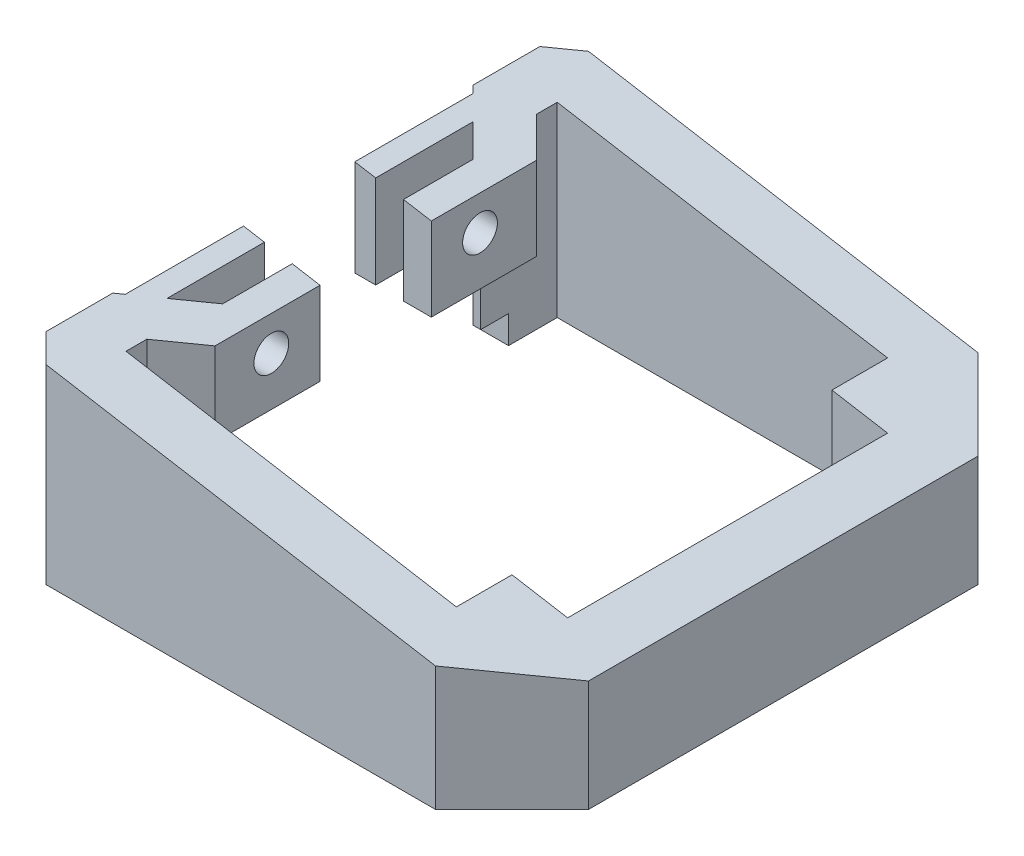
from build123d import *

# Parameters (mm, degrees)
SKETCH1_R                      = 1.1
BOSS_EXTRUDE1_DEPTH            = 7
BOSS_EXTRUDE2_DEPTH            = 7
SKETCH4_R                      = 1.25
CUT_EXTRUDE1_DEPTH             = 2
CUT_EXTRUDE3_REACH             = 49.937
SKETCH7_W                      = 8
SKETCH7_H                      = 14
CUT_EXTRUDE3_DIRECTION_2_DEPTH = 6
SKETCH8_R                      = 0.75
CUT_EXTRUDE4_DEPTH             = 2
CUT_EXTRUDE5_DEPTH             = 54.284613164
CUT_EXTRUDE6_DEPTH             = 7
SKETCH11_W                     = 3.483558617
SKETCH11_H                     = 24
CUT_EXTRUDE7_DEPTH             = 2


with BuildPart() as part:
    # Sketch1 → Boss-Extrude1 (new body)
    with BuildSketch(Plane(origin=(0, 0, 0), x_dir=(1, 0, 0), z_dir=(0, 1, 0))):
        Polygon((33.5, 0), (33.5, -28), (28, -33.5), (0, -33.5), (-1.75, -31.75), (-1.75, -24), (-1.3, -23.55), (-1.3, -4.45), (-1.75, -4), (-1.75, 3.75), (0, 5.5), (28, 5.5), align=None)
        with Locations(Location((0, 0, 0), (0, 0, 270))):
            Circle(SKETCH1_R, mode=Mode.SUBTRACT)
        with Locations(Location((28, 0, 0), (0, 0, 270))):
            Circle(SKETCH1_R, mode=Mode.SUBTRACT)
        with Locations(Location((0, -28, 0), (0, 0, 270))):
            Circle(SKETCH1_R, mode=Mode.SUBTRACT)
        with Locations(Location((28, -28, 0), (0, 0, 270))):
            Circle(SKETCH1_R, mode=Mode.SUBTRACT)
        Polygon((25.5, 1.5), (25.5, -2.5), (29.5, -2.5), (29.5, -25.5), (25.5, -25.5), (25.5, -29.5), (1.75, -29.5), (1.75, -28), (4.2, -25.55), (4.2, -2.45), (1.75, 0), (1.75, 1.5), align=None, mode=Mode.SUBTRACT)
        Polygon((2.2, -20.05), (2.2, -7.95), (0.2, -5.95), (0.2, -22.05), align=None, mode=Mode.SUBTRACT)
    extrude(amount=BOSS_EXTRUDE1_DEPTH)

    # Sketch2 → Boss-Extrude2 (add)
    with BuildSketch(Plane(origin=(0, 7, 0), x_dir=(1, 0, 0), z_dir=(0, 1, 0))):
        Polygon((0, 5.5), (-1.75, 3.75), (-1.75, -1.05), (-1.3, -1.5), (-1.3, -26.5), (-1.75, -26.95), (-1.75, -31.75), (0, -33.5), (28, -33.5), (33.5, -28), (33.5, 0), (28, 5.5), align=None)
        Polygon((2.2, -5), (2.2, -23), (0.2, -25), (0.2, -3), align=None, mode=Mode.SUBTRACT)
        Polygon((1.75, -28), (1.75, -29.5), (25.5, -29.5), (25.5, -25.5), (29.5, -25.5), (29.5, -2.5), (25.5, -2.5), (25.5, 1.5), (1.75, 1.5), (1.75, 0), (4.2, -2.45), (4.2, -25.55), align=None, mode=Mode.SUBTRACT)
    extrude(amount=BOSS_EXTRUDE2_DEPTH)

    # Sketch4 → Cut-Extrude1 (cut)
    with BuildSketch(Plane(origin=(4.2, 0, 0), x_dir=(0, 0, -1), z_dir=(1, 0, 0))):
        with Locations((-21.5, 10.5)):
            Circle(SKETCH4_R)
        with Locations((-6.5, 10.5)):
            Circle(SKETCH4_R)
    extrude(amount=-CUT_EXTRUDE1_DEPTH, mode=Mode.SUBTRACT)

    # Sketch7 → Cut-Extrude3 (cut, up to next)
    with BuildSketch(Plane.ZY.offset(-2.2), mode=Mode.PRIVATE) as cut_extrude3_sk1:
        with Locations((14, 7)):
            Rectangle(SKETCH7_W, SKETCH7_H)
    cut_extrude3_tool1 = extrude(cut_extrude3_sk1.sketch, amount=-CUT_EXTRUDE3_REACH, mode=Mode.PRIVATE) & part.part
    add(cut_extrude3_tool1.solids().sort_by_distance((2.2, 7, 14))[0], mode=Mode.SUBTRACT)

    # Sketch7 → Cut-Extrude3 direction 2 (cut)
    with BuildSketch(Plane.ZY.offset(-2.2)):
        with Locations((14, 7)):
            Rectangle(SKETCH7_W, SKETCH7_H)
    extrude(amount=CUT_EXTRUDE3_DIRECTION_2_DEPTH, mode=Mode.SUBTRACT)

    # Sketch8 → Cut-Extrude4 (cut)
    with BuildSketch(Plane(origin=(0.2, 0, 0), x_dir=(0, 0, -1), z_dir=(1, 0, 0))):
        with Locations((-21.5, 10.5)):
            Circle(SKETCH8_R)
        with Locations((-6.5, 10.5)):
            Circle(SKETCH8_R)
    extrude(amount=-CUT_EXTRUDE4_DEPTH, mode=Mode.SUBTRACT)

    # Sketch9 → Cut-Extrude5 (cut, through all)
    with BuildSketch(Plane.XY.offset(33.5)):
        Polygon((-1.75, 14), (33.5, 8), (33.5, 14), align=None)
    extrude(amount=-CUT_EXTRUDE5_DEPTH, mode=Mode.SUBTRACT)

    # Sketch10 → Cut-Extrude6 (cut)
    with BuildSketch(Plane.XZ):
        Polygon((-1.75, 26.95), (-1.75, 24), (-1.3, 23.55), (-1.3, 4.45), (-1.75, 4), (-1.75, 1.05), (1.2, 4), (1.75, 4), (1.75, 0), (4.2, 2.45), (4.2, 25.55), (1.75, 28), (1.75, 24), (1.2, 24), align=None)
    extrude(amount=-CUT_EXTRUDE6_DEPTH, mode=Mode.SUBTRACT)

    # Sketch11 → Cut-Extrude7 (cut)
    with BuildSketch(Plane(origin=(0, 0, 0), x_dir=(-1, 0, 0), z_dir=(0, -1, 0))):
        with Locations((-0.008220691, -14)):
            Rectangle(SKETCH11_W, SKETCH11_H)
    extrude(amount=-CUT_EXTRUDE7_DEPTH, mode=Mode.SUBTRACT)


solid = part.part
